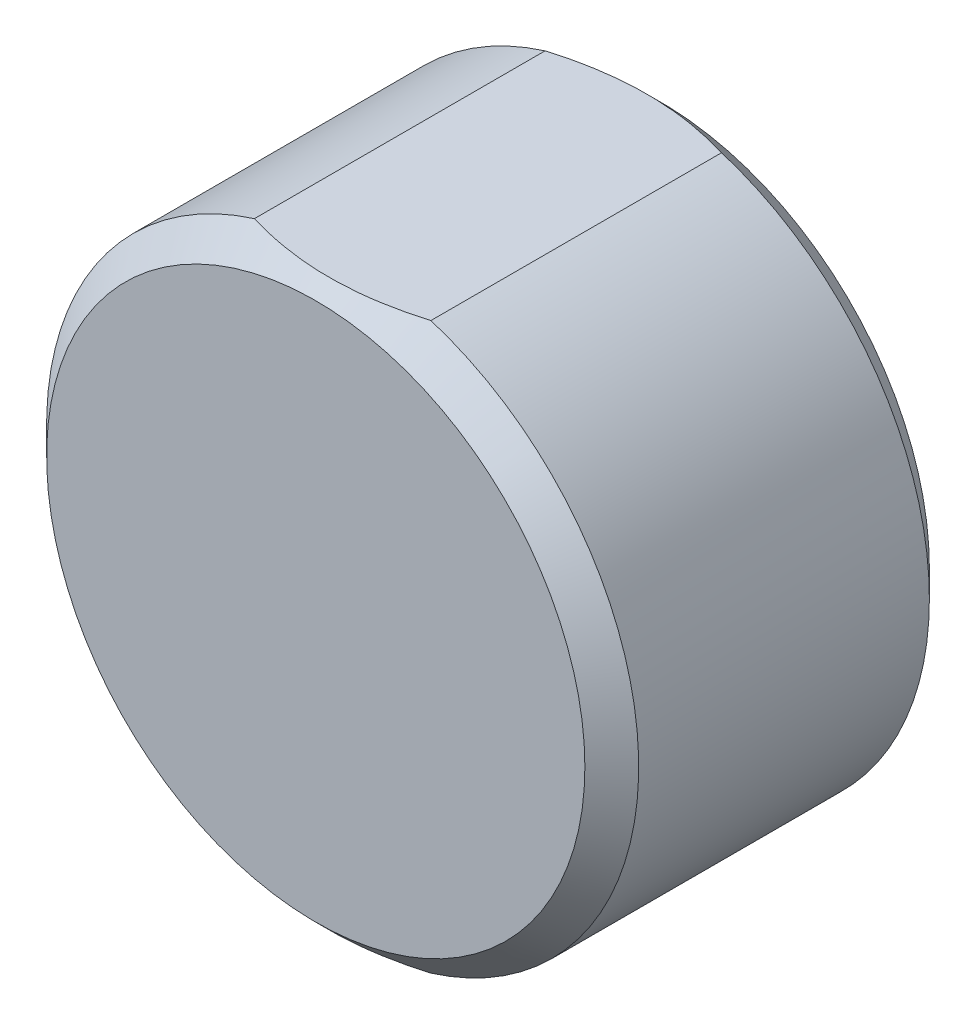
from build123d import *

# Parameters (mm, degrees)
SKIZZE1_R                       = 11
AUFSATZ_LINEAR_AUSTRAGEN1_DEPTH = 12.8
FASE1_SIZE                      = 1
SKIZZE2_W                       = 6.557438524
SKIZZE2_H                       = 0.5
SCHNITT_LINEAR_AUSTRAGEN1_DEPTH = 21.145470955


with BuildPart() as part:
    # Skizze1 → Aufsatz-Linear austragen1 (new body)
    with BuildSketch(Plane.XY):
        Circle(SKIZZE1_R)
    extrude(amount=AUFSATZ_LINEAR_AUSTRAGEN1_DEPTH)

    # Fase1
    fase1_edges = [part.edges().sort_by_distance(p)[0] for p in [
        (-11, 0, 0),
        (-11, 0, 12.8),
    ]]
    chamfer(fase1_edges, length=FASE1_SIZE)

    # Skizze2 → Schnitt-Linear austragen1 (cut, through all)
    with BuildSketch(Plane.XY.offset(12.8)):
        with Locations((0, 10.75)):
            Rectangle(SKIZZE2_W, SKIZZE2_H)
    schnitt_linear_austragen1 = extrude(amount=-SCHNITT_LINEAR_AUSTRAGEN1_DEPTH, mode=Mode.SUBTRACT)

    # Spiegeln1: Schnitt-Linear austragen1 across plane
    add(schnitt_linear_austragen1.mirror(Plane.ZX), mode=Mode.SUBTRACT)


solid = part.part
